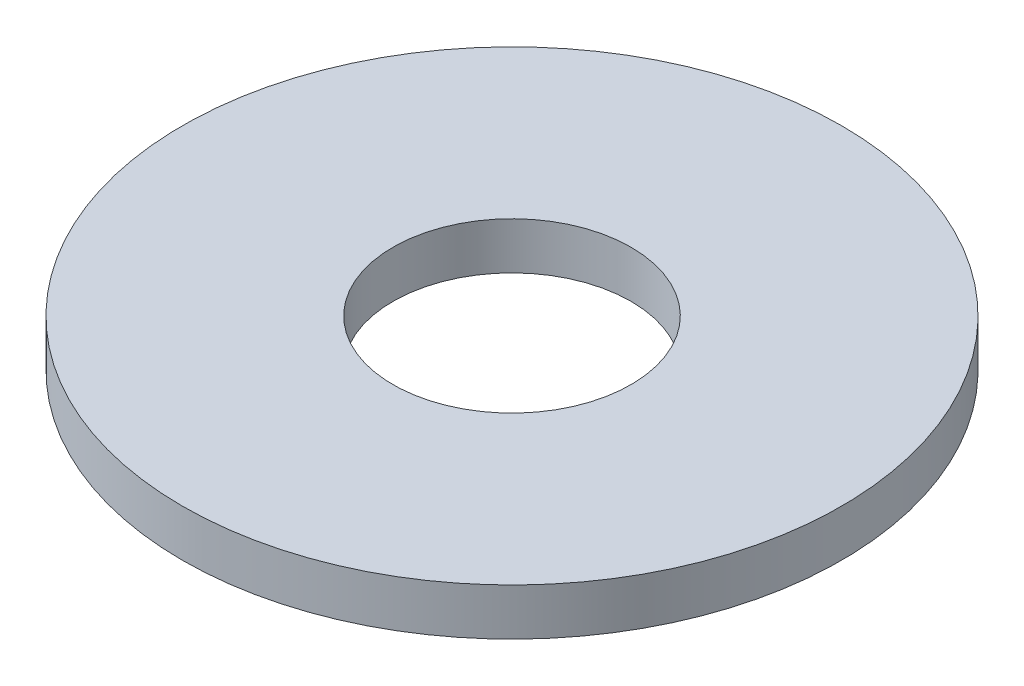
ISO-10303-21;
HEADER;
FILE_DESCRIPTION(('STEP AP214'),'2;1');
FILE_NAME('part.step','',(''),(''),'','','');
FILE_SCHEMA(('AUTOMOTIVE_DESIGN { 1 0 10303 214 1 1 1 1 }'));
ENDSEC;
DATA;
#1=APPLICATION_CONTEXT('core data for automotive mechanical design processes');
#2=APPLICATION_PROTOCOL_DEFINITION('international standard','automotive_design',2000,#1);
#3=PRODUCT_CONTEXT('',#1,'mechanical');
#4=PRODUCT('Part','Part','',(#3));
#5=PRODUCT_RELATED_PRODUCT_CATEGORY('part','',(#4));
#6=PRODUCT_DEFINITION_FORMATION('','',#4);
#7=PRODUCT_DEFINITION_CONTEXT('part definition',#1,'design');
#8=PRODUCT_DEFINITION('design','',#6,#7);
#9=PRODUCT_DEFINITION_SHAPE('','',#8);
#10=(LENGTH_UNIT() NAMED_UNIT(*) SI_UNIT(.MILLI.,.METRE.));
#11=(NAMED_UNIT(*) PLANE_ANGLE_UNIT() SI_UNIT($,.RADIAN.));
#12=(NAMED_UNIT(*) SI_UNIT($,.STERADIAN.) SOLID_ANGLE_UNIT());
#13=UNCERTAINTY_MEASURE_WITH_UNIT(LENGTH_MEASURE(1.E-05),#10,'distance_accuracy_value','');
#14=(GEOMETRIC_REPRESENTATION_CONTEXT(3) GLOBAL_UNCERTAINTY_ASSIGNED_CONTEXT((#13)) GLOBAL_UNIT_ASSIGNED_CONTEXT((#10,
#11,#12)) REPRESENTATION_CONTEXT('',''));
#15=CARTESIAN_POINT('',(0.,0.,0.));
#16=DIRECTION('',(0.,0.,1.));
#17=DIRECTION('',(1.,0.,0.));
#18=AXIS2_PLACEMENT_3D('',#15,#16,#17);
#19=CARTESIAN_POINT('',(7.13740000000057,2.4980018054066E-13,-2.04697370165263E-13));
#20=DIRECTION('',(0.,-1.,0.));
#21=DIRECTION('',(0.,0.,-1.));
#22=AXIS2_PLACEMENT_3D('',#19,#20,#21);
#23=PLANE('',#22);
#24=CARTESIAN_POINT('',(3.33066907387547E-13,2.22044604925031E-13,-2.25514051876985E-13));
#25=DIRECTION('',(0.,-1.,0.));
#26=DIRECTION('',(0.,0.,-1.));
#27=AXIS2_PLACEMENT_3D('',#24,#25,#26);
#28=CIRCLE('',#27,7.1374);
#29=CARTESIAN_POINT('',(3.36236549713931E-13,2.22044604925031E-13,-7.13740000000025));
#30=VERTEX_POINT('',#29);
#31=EDGE_CURVE('E44',#30,#30,#28,.T.);
#32=ORIENTED_EDGE('',*,*,#31,.T.);
#33=EDGE_LOOP('',(#32));
#34=FACE_BOUND('',#33,.T.);
#35=CARTESIAN_POINT('',(3.33066907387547E-13,2.22044604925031E-13,-2.25514051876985E-13));
#36=DIRECTION('',(0.,-1.,0.));
#37=DIRECTION('',(0.,0.,-1.));
#38=AXIS2_PLACEMENT_3D('',#35,#36,#37);
#39=CIRCLE('',#38,2.5781);
#40=CARTESIAN_POINT('',(3.34211813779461E-13,2.22044604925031E-13,-2.57810000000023));
#41=VERTEX_POINT('',#40);
#42=EDGE_CURVE('E10',#41,#41,#39,.T.);
#43=ORIENTED_EDGE('',*,*,#42,.F.);
#44=EDGE_LOOP('',(#43));
#45=FACE_BOUND('',#44,.T.);
#46=ADVANCED_FACE('F30',(#34,#45),#23,.T.);
#47=CARTESIAN_POINT('',(1.80411241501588E-13,-50.7999999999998,-1.83880688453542E-13));
#48=DIRECTION('',(0.,-1.,0.));
#49=DIRECTION('',(0.,0.,-1.));
#50=AXIS2_PLACEMENT_3D('',#47,#48,#49);
#51=CYLINDRICAL_SURFACE('',#50,2.5781);
#52=ORIENTED_EDGE('',*,*,#42,.T.);
#53=EDGE_LOOP('',(#52));
#54=FACE_BOUND('',#53,.T.);
#55=CARTESIAN_POINT('',(4.71844785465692E-13,1.01600000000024,-1.59594559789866E-13));
#56=DIRECTION('',(0.,-1.,0.));
#57=DIRECTION('',(0.,0.,-1.));
#58=AXIS2_PLACEMENT_3D('',#55,#56,#57);
#59=CIRCLE('',#58,2.5781);
#60=CARTESIAN_POINT('',(4.72989691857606E-13,1.01600000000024,-2.57810000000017));
#61=VERTEX_POINT('',#60);
#62=EDGE_CURVE('E36',#61,#61,#59,.T.);
#63=ORIENTED_EDGE('',*,*,#62,.F.);
#64=EDGE_LOOP('',(#63));
#65=FACE_BOUND('',#64,.T.);
#66=ADVANCED_FACE('F60',(#54,#65),#51,.F.);
#67=CARTESIAN_POINT('',(2.57810000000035,1.01600000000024,-1.56125112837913E-13));
#68=DIRECTION('',(0.,1.,0.));
#69=DIRECTION('',(0.,0.,1.));
#70=AXIS2_PLACEMENT_3D('',#67,#68,#69);
#71=PLANE('',#70);
#72=ORIENTED_EDGE('',*,*,#62,.T.);
#73=EDGE_LOOP('',(#72));
#74=FACE_BOUND('',#73,.T.);
#75=CARTESIAN_POINT('',(4.71844785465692E-13,1.01600000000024,-1.59594559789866E-13));
#76=DIRECTION('',(0.,-1.,0.));
#77=DIRECTION('',(0.,0.,-1.));
#78=AXIS2_PLACEMENT_3D('',#75,#76,#77);
#79=CIRCLE('',#78,7.1374);
#80=CARTESIAN_POINT('',(4.75014427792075E-13,1.01600000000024,-7.13740000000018));
#81=VERTEX_POINT('',#80);
#82=EDGE_CURVE('E40',#81,#81,#79,.T.);
#83=ORIENTED_EDGE('',*,*,#82,.F.);
#84=EDGE_LOOP('',(#83));
#85=FACE_BOUND('',#84,.T.);
#86=ADVANCED_FACE('F54',(#74,#85),#71,.T.);
#87=CARTESIAN_POINT('',(1.80411241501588E-13,-50.7999999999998,-1.83880688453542E-13));
#88=DIRECTION('',(0.,-1.,0.));
#89=DIRECTION('',(0.,0.,-1.));
#90=AXIS2_PLACEMENT_3D('',#87,#88,#89);
#91=CYLINDRICAL_SURFACE('',#90,7.1374);
#92=ORIENTED_EDGE('',*,*,#82,.T.);
#93=EDGE_LOOP('',(#92));
#94=FACE_BOUND('',#93,.T.);
#95=ORIENTED_EDGE('',*,*,#31,.F.);
#96=EDGE_LOOP('',(#95));
#97=FACE_BOUND('',#96,.T.);
#98=ADVANCED_FACE('F52',(#94,#97),#91,.T.);
#99=CLOSED_SHELL('',(#46,#66,#86,#98));
#100=MANIFOLD_SOLID_BREP('B2',#99);
#101=ADVANCED_BREP_SHAPE_REPRESENTATION('',(#18,#100),#14);
#102=SHAPE_DEFINITION_REPRESENTATION(#9,#101);
ENDSEC;
END-ISO-10303-21;
